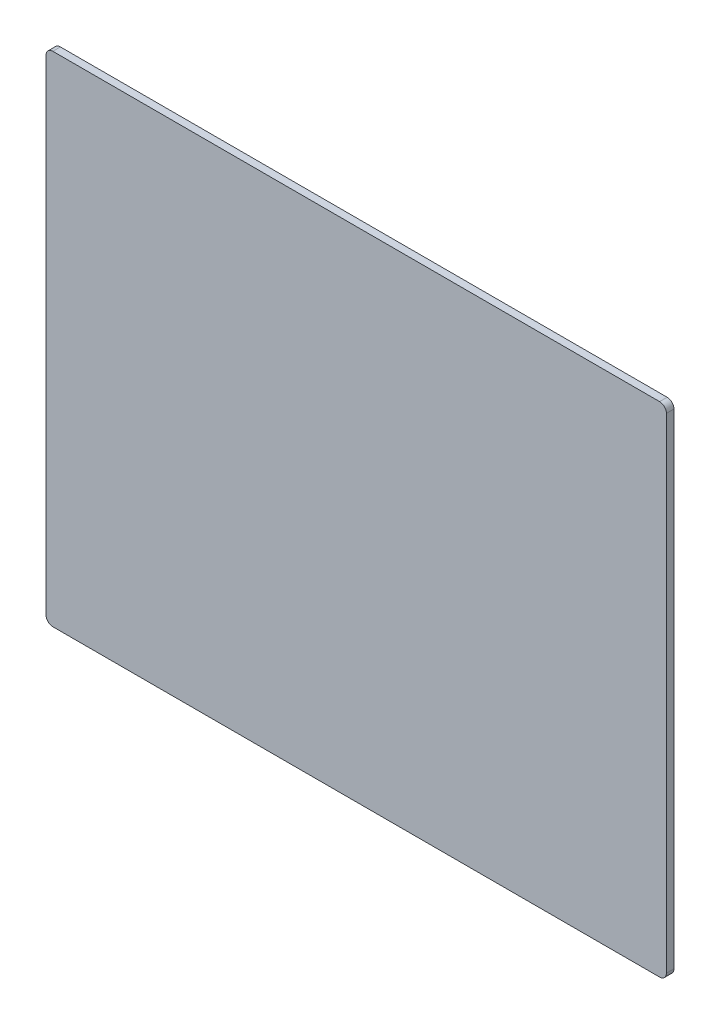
ISO-10303-21;
HEADER;
FILE_DESCRIPTION(('STEP AP214'),'2;1');
FILE_NAME('part.step','',(''),(''),'','','');
FILE_SCHEMA(('AUTOMOTIVE_DESIGN { 1 0 10303 214 1 1 1 1 }'));
ENDSEC;
DATA;
#1=APPLICATION_CONTEXT('core data for automotive mechanical design processes');
#2=APPLICATION_PROTOCOL_DEFINITION('international standard','automotive_design',2000,#1);
#3=PRODUCT_CONTEXT('',#1,'mechanical');
#4=PRODUCT('Part','Part','',(#3));
#5=PRODUCT_RELATED_PRODUCT_CATEGORY('part','',(#4));
#6=PRODUCT_DEFINITION_FORMATION('','',#4);
#7=PRODUCT_DEFINITION_CONTEXT('part definition',#1,'design');
#8=PRODUCT_DEFINITION('design','',#6,#7);
#9=PRODUCT_DEFINITION_SHAPE('','',#8);
#10=(LENGTH_UNIT() NAMED_UNIT(*) SI_UNIT(.MILLI.,.METRE.));
#11=(NAMED_UNIT(*) PLANE_ANGLE_UNIT() SI_UNIT($,.RADIAN.));
#12=(NAMED_UNIT(*) SI_UNIT($,.STERADIAN.) SOLID_ANGLE_UNIT());
#13=UNCERTAINTY_MEASURE_WITH_UNIT(LENGTH_MEASURE(1.E-05),#10,'distance_accuracy_value','');
#14=(GEOMETRIC_REPRESENTATION_CONTEXT(3) GLOBAL_UNCERTAINTY_ASSIGNED_CONTEXT((#13)) GLOBAL_UNIT_ASSIGNED_CONTEXT((#10,
#11,#12)) REPRESENTATION_CONTEXT('',''));
#15=CARTESIAN_POINT('',(0.,0.,0.));
#16=DIRECTION('',(0.,0.,1.));
#17=DIRECTION('',(1.,0.,0.));
#18=AXIS2_PLACEMENT_3D('',#15,#16,#17);
#19=CARTESIAN_POINT('',(500.264886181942,172.46092,2.54));
#20=DIRECTION('',(0.,0.,-1.));
#21=DIRECTION('',(-1.,0.,0.));
#22=AXIS2_PLACEMENT_3D('',#19,#20,#21);
#23=CYLINDRICAL_SURFACE('',#22,2.286);
#24=CARTESIAN_POINT('',(500.264886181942,172.46092,0.));
#25=DIRECTION('',(0.,0.,1.));
#26=DIRECTION('',(1.,0.,0.));
#27=AXIS2_PLACEMENT_3D('',#24,#25,#26);
#28=CIRCLE('',#27,2.286);
#29=CARTESIAN_POINT('',(502.550886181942,172.46092,0.));
#30=VERTEX_POINT('',#29);
#31=CARTESIAN_POINT('',(500.264886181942,174.74692,0.));
#32=VERTEX_POINT('',#31);
#33=EDGE_CURVE('E139',#30,#32,#28,.T.);
#34=ORIENTED_EDGE('',*,*,#33,.T.);
#35=DIRECTION('',(0.,0.,-1.));
#36=VECTOR('',#35,1.);
#37=CARTESIAN_POINT('',(500.264886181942,174.74692,2.54));
#38=LINE('',#37,#36);
#39=CARTESIAN_POINT('',(500.264886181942,174.74692,2.54));
#40=VERTEX_POINT('',#39);
#41=EDGE_CURVE('E12',#40,#32,#38,.T.);
#42=ORIENTED_EDGE('',*,*,#41,.F.);
#43=CARTESIAN_POINT('',(500.264886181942,172.46092,2.54));
#44=DIRECTION('',(0.,0.,1.));
#45=DIRECTION('',(1.,0.,0.));
#46=AXIS2_PLACEMENT_3D('',#43,#44,#45);
#47=CIRCLE('',#46,2.286);
#48=CARTESIAN_POINT('',(502.550886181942,172.46092,2.54));
#49=VERTEX_POINT('',#48);
#50=EDGE_CURVE('E156',#49,#40,#47,.T.);
#51=ORIENTED_EDGE('',*,*,#50,.F.);
#52=DIRECTION('',(0.,0.,-1.));
#53=VECTOR('',#52,1.);
#54=CARTESIAN_POINT('',(502.550886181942,172.46092,2.54));
#55=LINE('',#54,#53);
#56=EDGE_CURVE('E135',#49,#30,#55,.T.);
#57=ORIENTED_EDGE('',*,*,#56,.T.);
#58=EDGE_LOOP('',(#34,#42,#51,#57));
#59=FACE_BOUND('',#58,.T.);
#60=ADVANCED_FACE('F40',(#59),#23,.T.);
#61=CARTESIAN_POINT('',(500.264886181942,174.74692,2.54));
#62=DIRECTION('',(0.,-1.,0.));
#63=DIRECTION('',(0.,0.,-1.));
#64=AXIS2_PLACEMENT_3D('',#61,#62,#63);
#65=PLANE('',#64);
#66=DIRECTION('',(-1.,0.,0.));
#67=VECTOR('',#66,1.);
#68=CARTESIAN_POINT('',(500.264886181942,174.74692,0.));
#69=LINE('',#68,#67);
#70=CARTESIAN_POINT('',(296.343526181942,174.74692,0.));
#71=VERTEX_POINT('',#70);
#72=EDGE_CURVE('E142',#32,#71,#69,.T.);
#73=ORIENTED_EDGE('',*,*,#72,.T.);
#74=DIRECTION('',(0.,0.,-1.));
#75=VECTOR('',#74,1.);
#76=CARTESIAN_POINT('',(296.343526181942,174.74692,2.54));
#77=LINE('',#76,#75);
#78=CARTESIAN_POINT('',(296.343526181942,174.74692,2.54));
#79=VERTEX_POINT('',#78);
#80=EDGE_CURVE('E47',#79,#71,#77,.T.);
#81=ORIENTED_EDGE('',*,*,#80,.F.);
#82=DIRECTION('',(-1.,0.,0.));
#83=VECTOR('',#82,1.);
#84=CARTESIAN_POINT('',(500.264886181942,174.74692,2.54));
#85=LINE('',#84,#83);
#86=EDGE_CURVE('E100',#40,#79,#85,.T.);
#87=ORIENTED_EDGE('',*,*,#86,.F.);
#88=ORIENTED_EDGE('',*,*,#41,.T.);
#89=EDGE_LOOP('',(#73,#81,#87,#88));
#90=FACE_BOUND('',#89,.T.);
#91=ADVANCED_FACE('F211',(#90),#65,.F.);
#92=CARTESIAN_POINT('',(296.343526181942,172.46092,2.54));
#93=DIRECTION('',(0.,0.,-1.));
#94=DIRECTION('',(-1.,0.,0.));
#95=AXIS2_PLACEMENT_3D('',#92,#93,#94);
#96=CYLINDRICAL_SURFACE('',#95,2.286);
#97=CARTESIAN_POINT('',(296.343526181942,172.46092,0.));
#98=DIRECTION('',(0.,0.,1.));
#99=DIRECTION('',(-1.,0.,0.));
#100=AXIS2_PLACEMENT_3D('',#97,#98,#99);
#101=CIRCLE('',#100,2.286);
#102=CARTESIAN_POINT('',(294.057526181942,172.46092,0.));
#103=VERTEX_POINT('',#102);
#104=EDGE_CURVE('E145',#71,#103,#101,.T.);
#105=ORIENTED_EDGE('',*,*,#104,.T.);
#106=DIRECTION('',(0.,0.,-1.));
#107=VECTOR('',#106,1.);
#108=CARTESIAN_POINT('',(294.057526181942,172.46092,2.54));
#109=LINE('',#108,#107);
#110=CARTESIAN_POINT('',(294.057526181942,172.46092,2.54));
#111=VERTEX_POINT('',#110);
#112=EDGE_CURVE('E163',#111,#103,#109,.T.);
#113=ORIENTED_EDGE('',*,*,#112,.F.);
#114=CARTESIAN_POINT('',(296.343526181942,172.46092,2.54));
#115=DIRECTION('',(0.,0.,1.));
#116=DIRECTION('',(-1.,0.,0.));
#117=AXIS2_PLACEMENT_3D('',#114,#115,#116);
#118=CIRCLE('',#117,2.286);
#119=EDGE_CURVE('E173',#79,#111,#118,.T.);
#120=ORIENTED_EDGE('',*,*,#119,.F.);
#121=ORIENTED_EDGE('',*,*,#80,.T.);
#122=EDGE_LOOP('',(#105,#113,#120,#121));
#123=FACE_BOUND('',#122,.T.);
#124=ADVANCED_FACE('F215',(#123),#96,.T.);
#125=CARTESIAN_POINT('',(294.057526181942,172.46092,2.54));
#126=DIRECTION('',(1.,0.,0.));
#127=DIRECTION('',(0.,0.,-1.));
#128=AXIS2_PLACEMENT_3D('',#125,#126,#127);
#129=PLANE('',#128);
#130=DIRECTION('',(0.,-1.,0.));
#131=VECTOR('',#130,1.);
#132=CARTESIAN_POINT('',(294.057526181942,172.46092,0.));
#133=LINE('',#132,#131);
#134=CARTESIAN_POINT('',(294.057526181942,9.54024000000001,0.));
#135=VERTEX_POINT('',#134);
#136=EDGE_CURVE('E148',#103,#135,#133,.T.);
#137=ORIENTED_EDGE('',*,*,#136,.T.);
#138=DIRECTION('',(0.,0.,-1.));
#139=VECTOR('',#138,1.);
#140=CARTESIAN_POINT('',(294.057526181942,9.54024000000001,2.54));
#141=LINE('',#140,#139);
#142=CARTESIAN_POINT('',(294.057526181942,9.54024000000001,2.54));
#143=VERTEX_POINT('',#142);
#144=EDGE_CURVE('E160',#143,#135,#141,.T.);
#145=ORIENTED_EDGE('',*,*,#144,.F.);
#146=DIRECTION('',(0.,-1.,0.));
#147=VECTOR('',#146,1.);
#148=CARTESIAN_POINT('',(294.057526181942,172.46092,2.54));
#149=LINE('',#148,#147);
#150=EDGE_CURVE('E177',#111,#143,#149,.T.);
#151=ORIENTED_EDGE('',*,*,#150,.F.);
#152=ORIENTED_EDGE('',*,*,#112,.T.);
#153=EDGE_LOOP('',(#137,#145,#151,#152));
#154=FACE_BOUND('',#153,.T.);
#155=ADVANCED_FACE('F188',(#154),#129,.F.);
#156=CARTESIAN_POINT('',(296.343526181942,9.54024,2.54));
#157=DIRECTION('',(0.,0.,-1.));
#158=DIRECTION('',(-1.,0.,0.));
#159=AXIS2_PLACEMENT_3D('',#156,#157,#158);
#160=CYLINDRICAL_SURFACE('',#159,2.28600000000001);
#161=CARTESIAN_POINT('',(296.343526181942,9.54024,0.));
#162=DIRECTION('',(0.,0.,1.));
#163=DIRECTION('',(-1.,0.,0.));
#164=AXIS2_PLACEMENT_3D('',#161,#162,#163);
#165=CIRCLE('',#164,2.28600000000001);
#166=CARTESIAN_POINT('',(296.343526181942,7.25424,0.));
#167=VERTEX_POINT('',#166);
#168=EDGE_CURVE('E151',#135,#167,#165,.T.);
#169=ORIENTED_EDGE('',*,*,#168,.T.);
#170=DIRECTION('',(0.,0.,-1.));
#171=VECTOR('',#170,1.);
#172=CARTESIAN_POINT('',(296.343526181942,7.25424,2.54));
#173=LINE('',#172,#171);
#174=CARTESIAN_POINT('',(296.343526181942,7.25424,2.54));
#175=VERTEX_POINT('',#174);
#176=EDGE_CURVE('E130',#175,#167,#173,.T.);
#177=ORIENTED_EDGE('',*,*,#176,.F.);
#178=CARTESIAN_POINT('',(296.343526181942,9.54024,2.54));
#179=DIRECTION('',(0.,0.,1.));
#180=DIRECTION('',(-1.,0.,0.));
#181=AXIS2_PLACEMENT_3D('',#178,#179,#180);
#182=CIRCLE('',#181,2.28600000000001);
#183=EDGE_CURVE('E121',#143,#175,#182,.T.);
#184=ORIENTED_EDGE('',*,*,#183,.F.);
#185=ORIENTED_EDGE('',*,*,#144,.T.);
#186=EDGE_LOOP('',(#169,#177,#184,#185));
#187=FACE_BOUND('',#186,.T.);
#188=ADVANCED_FACE('F192',(#187),#160,.T.);
#189=CARTESIAN_POINT('',(296.343526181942,7.25424,2.54));
#190=DIRECTION('',(0.,1.,0.));
#191=DIRECTION('',(-1.,0.,0.));
#192=AXIS2_PLACEMENT_3D('',#189,#190,#191);
#193=PLANE('',#192);
#194=DIRECTION('',(1.,0.,0.));
#195=VECTOR('',#194,1.);
#196=CARTESIAN_POINT('',(296.343526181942,7.25424,0.));
#197=LINE('',#196,#195);
#198=CARTESIAN_POINT('',(500.264886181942,7.25424,0.));
#199=VERTEX_POINT('',#198);
#200=EDGE_CURVE('E129',#167,#199,#197,.T.);
#201=ORIENTED_EDGE('',*,*,#200,.T.);
#202=DIRECTION('',(0.,0.,-1.));
#203=VECTOR('',#202,1.);
#204=CARTESIAN_POINT('',(500.264886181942,7.25424,2.54));
#205=LINE('',#204,#203);
#206=CARTESIAN_POINT('',(500.264886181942,7.25424,2.54));
#207=VERTEX_POINT('',#206);
#208=EDGE_CURVE('E126',#207,#199,#205,.T.);
#209=ORIENTED_EDGE('',*,*,#208,.F.);
#210=DIRECTION('',(1.,0.,0.));
#211=VECTOR('',#210,1.);
#212=CARTESIAN_POINT('',(296.343526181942,7.25424,2.54));
#213=LINE('',#212,#211);
#214=EDGE_CURVE('E115',#175,#207,#213,.T.);
#215=ORIENTED_EDGE('',*,*,#214,.F.);
#216=ORIENTED_EDGE('',*,*,#176,.T.);
#217=EDGE_LOOP('',(#201,#209,#215,#216));
#218=FACE_BOUND('',#217,.T.);
#219=ADVANCED_FACE('F127',(#218),#193,.F.);
#220=CARTESIAN_POINT('',(500.264886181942,9.54024,2.54));
#221=DIRECTION('',(0.,0.,-1.));
#222=DIRECTION('',(-1.,0.,0.));
#223=AXIS2_PLACEMENT_3D('',#220,#221,#222);
#224=CYLINDRICAL_SURFACE('',#223,2.286);
#225=CARTESIAN_POINT('',(500.264886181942,9.54024,0.));
#226=DIRECTION('',(0.,0.,1.));
#227=DIRECTION('',(-1.,0.,0.));
#228=AXIS2_PLACEMENT_3D('',#225,#226,#227);
#229=CIRCLE('',#228,2.286);
#230=CARTESIAN_POINT('',(502.550886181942,9.54024000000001,0.));
#231=VERTEX_POINT('',#230);
#232=EDGE_CURVE('E86',#199,#231,#229,.T.);
#233=ORIENTED_EDGE('',*,*,#232,.T.);
#234=DIRECTION('',(0.,0.,-1.));
#235=VECTOR('',#234,1.);
#236=CARTESIAN_POINT('',(502.550886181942,9.54024000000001,2.54));
#237=LINE('',#236,#235);
#238=CARTESIAN_POINT('',(502.550886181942,9.54024000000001,2.54));
#239=VERTEX_POINT('',#238);
#240=EDGE_CURVE('E131',#239,#231,#237,.T.);
#241=ORIENTED_EDGE('',*,*,#240,.F.);
#242=CARTESIAN_POINT('',(500.264886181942,9.54024,2.54));
#243=DIRECTION('',(0.,0.,1.));
#244=DIRECTION('',(-1.,0.,0.));
#245=AXIS2_PLACEMENT_3D('',#242,#243,#244);
#246=CIRCLE('',#245,2.286);
#247=EDGE_CURVE('E119',#207,#239,#246,.T.);
#248=ORIENTED_EDGE('',*,*,#247,.F.);
#249=ORIENTED_EDGE('',*,*,#208,.T.);
#250=EDGE_LOOP('',(#233,#241,#248,#249));
#251=FACE_BOUND('',#250,.T.);
#252=ADVANCED_FACE('F133',(#251),#224,.T.);
#253=CARTESIAN_POINT('',(502.550886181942,172.46092,2.54));
#254=DIRECTION('',(-1.,0.,0.));
#255=DIRECTION('',(0.,0.,1.));
#256=AXIS2_PLACEMENT_3D('',#253,#254,#255);
#257=PLANE('',#256);
#258=DIRECTION('',(0.,1.,0.));
#259=VECTOR('',#258,1.);
#260=CARTESIAN_POINT('',(502.550886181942,172.46092,0.));
#261=LINE('',#260,#259);
#262=EDGE_CURVE('E92',#231,#30,#261,.T.);
#263=ORIENTED_EDGE('',*,*,#262,.T.);
#264=ORIENTED_EDGE('',*,*,#56,.F.);
#265=DIRECTION('',(0.,1.,0.));
#266=VECTOR('',#265,1.);
#267=CARTESIAN_POINT('',(502.550886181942,172.46092,2.54));
#268=LINE('',#267,#266);
#269=EDGE_CURVE('E55',#239,#49,#268,.T.);
#270=ORIENTED_EDGE('',*,*,#269,.F.);
#271=ORIENTED_EDGE('',*,*,#240,.T.);
#272=EDGE_LOOP('',(#263,#264,#270,#271));
#273=FACE_BOUND('',#272,.T.);
#274=ADVANCED_FACE('F200',(#273),#257,.F.);
#275=CARTESIAN_POINT('',(500.264886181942,172.46092,2.54));
#276=DIRECTION('',(0.,0.,1.));
#277=DIRECTION('',(1.,0.,0.));
#278=AXIS2_PLACEMENT_3D('',#275,#276,#277);
#279=PLANE('',#278);
#280=ORIENTED_EDGE('',*,*,#50,.T.);
#281=ORIENTED_EDGE('',*,*,#86,.T.);
#282=ORIENTED_EDGE('',*,*,#119,.T.);
#283=ORIENTED_EDGE('',*,*,#150,.T.);
#284=ORIENTED_EDGE('',*,*,#183,.T.);
#285=ORIENTED_EDGE('',*,*,#214,.T.);
#286=ORIENTED_EDGE('',*,*,#247,.T.);
#287=ORIENTED_EDGE('',*,*,#269,.T.);
#288=EDGE_LOOP('',(#280,#281,#282,#283,#284,#285,#286,#287));
#289=FACE_BOUND('',#288,.T.);
#290=ADVANCED_FACE('F117',(#289),#279,.T.);
#291=CARTESIAN_POINT('',(500.264886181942,172.46092,0.));
#292=DIRECTION('',(0.,0.,1.));
#293=DIRECTION('',(1.,0.,0.));
#294=AXIS2_PLACEMENT_3D('',#291,#292,#293);
#295=PLANE('',#294);
#296=ORIENTED_EDGE('',*,*,#33,.F.);
#297=ORIENTED_EDGE('',*,*,#262,.F.);
#298=ORIENTED_EDGE('',*,*,#232,.F.);
#299=ORIENTED_EDGE('',*,*,#200,.F.);
#300=ORIENTED_EDGE('',*,*,#168,.F.);
#301=ORIENTED_EDGE('',*,*,#136,.F.);
#302=ORIENTED_EDGE('',*,*,#104,.F.);
#303=ORIENTED_EDGE('',*,*,#72,.F.);
#304=EDGE_LOOP('',(#296,#297,#298,#299,#300,#301,#302,#303));
#305=FACE_BOUND('',#304,.T.);
#306=ADVANCED_FACE('F195',(#305),#295,.F.);
#307=CLOSED_SHELL('',(#60,#91,#124,#155,#188,#219,#252,#274,#290,#306));
#308=MANIFOLD_SOLID_BREP('B2',#307);
#309=ADVANCED_BREP_SHAPE_REPRESENTATION('',(#18,#308),#14);
#310=SHAPE_DEFINITION_REPRESENTATION(#9,#309);
ENDSEC;
END-ISO-10303-21;
